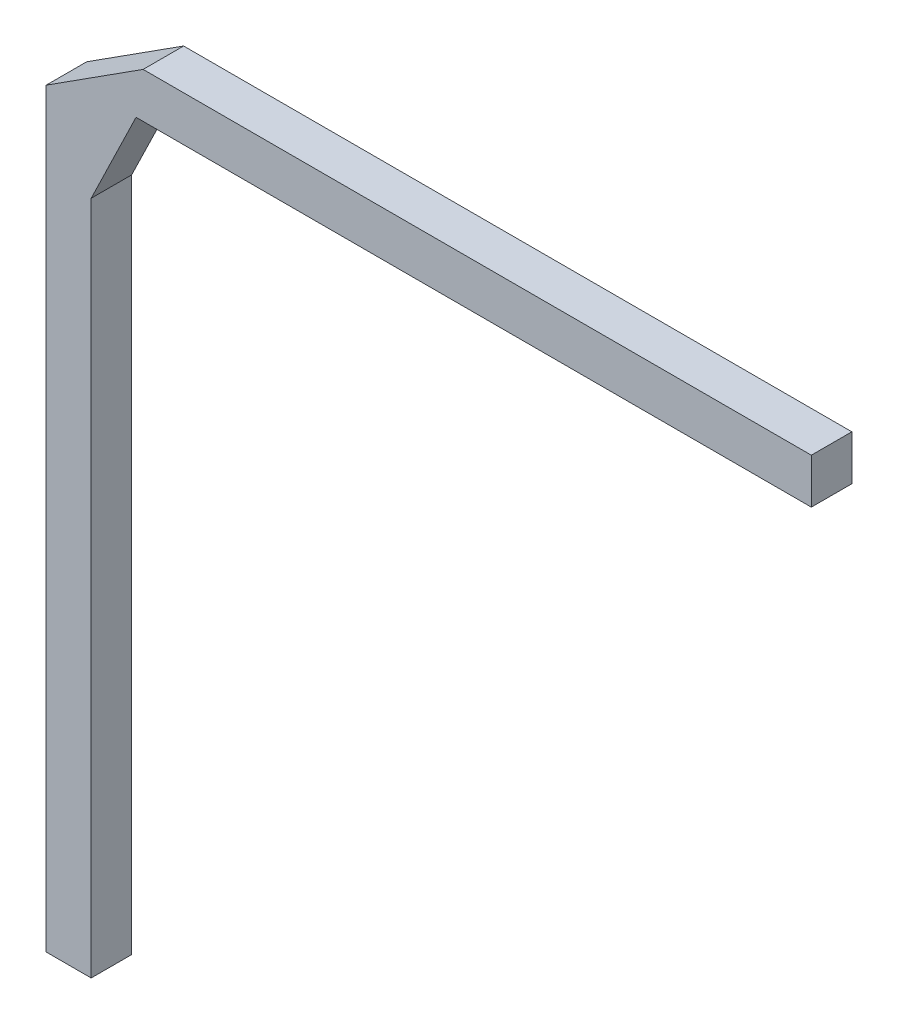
from build123d import *

# Parameters (mm, degrees)
BOSS_EXTRUDE1_DEPTH = 0.9


with BuildPart() as part:
    # Sketch1 → Boss-Extrude1 (new body)
    with BuildSketch(Plane.XY):
        Polygon((7.953849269, -1.8), (8.953849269, -1.8), (8.953849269, 13.2), (9.95081428, 15.255909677), (24.95081428, 15.255909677), (24.95081428, 16.255909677), (10.107906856, 16.255909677), (7.953849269, 14.875478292), align=None)
    extrude(amount=BOSS_EXTRUDE1_DEPTH)


solid = part.part
